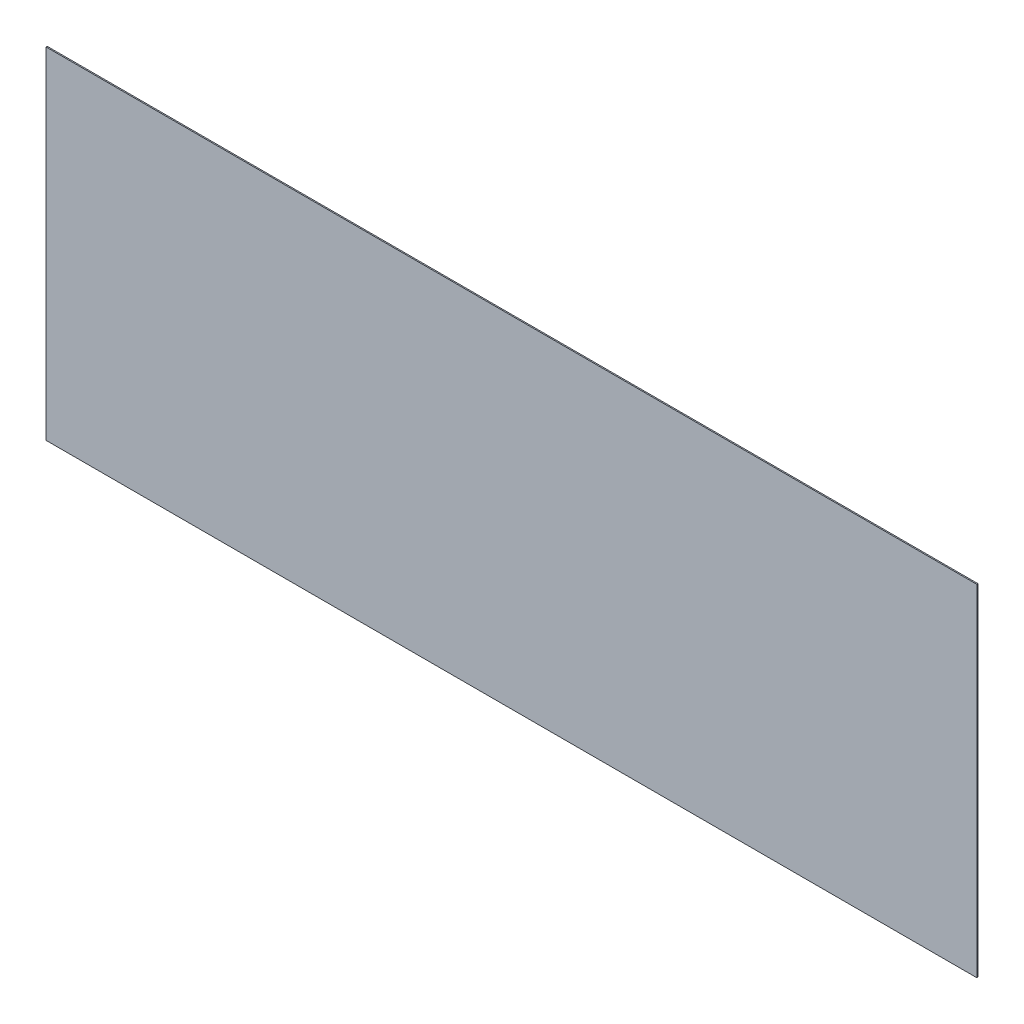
from build123d import *

# Parameters (mm, degrees)
ESQUISSE1_W        = 2650
ESQUISSE1_H        = 970
BOSS_EXTRU_1_DEPTH = 3.307392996


with BuildPart() as part:
    # Esquisse1 → Boss.-Extru.1 (new body)
    with BuildSketch(Plane.XY):
        Rectangle(ESQUISSE1_W, ESQUISSE1_H)
    extrude(amount=BOSS_EXTRU_1_DEPTH)


solid = part.part
